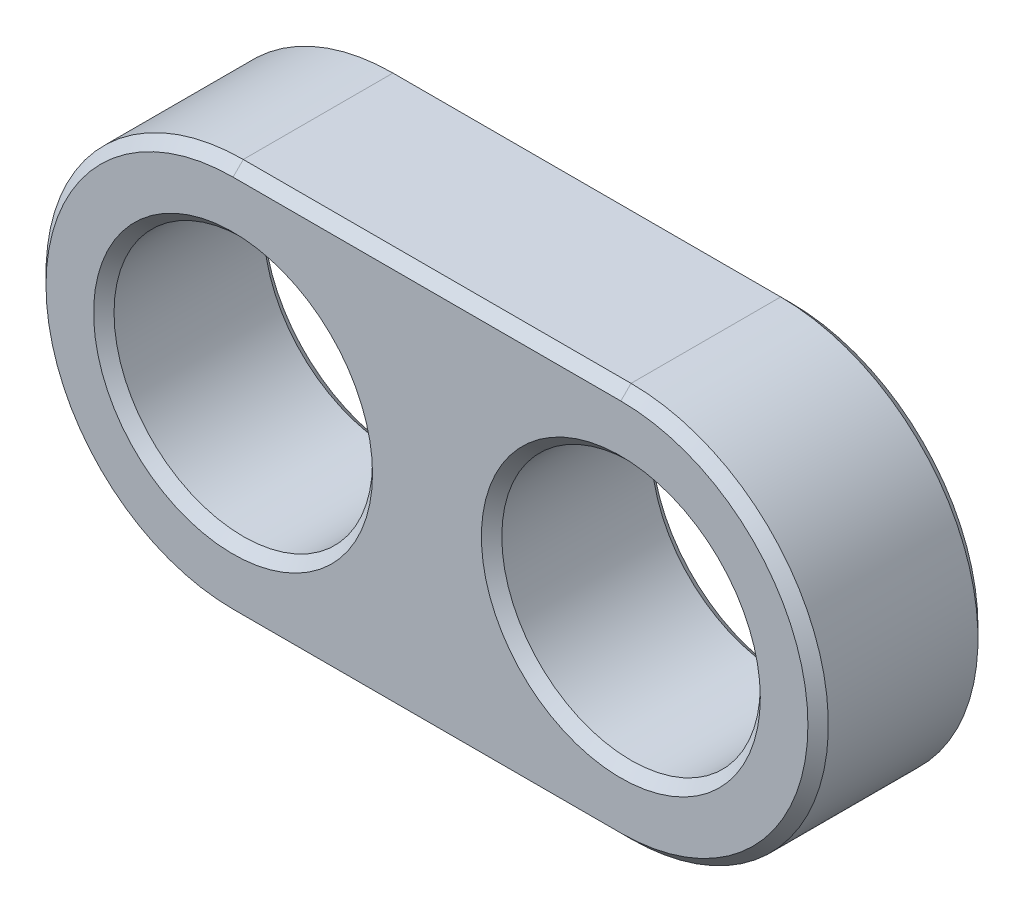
ISO-10303-21;
HEADER;
FILE_DESCRIPTION(('STEP AP214'),'2;1');
FILE_NAME('part.step','',(''),(''),'','','');
FILE_SCHEMA(('AUTOMOTIVE_DESIGN { 1 0 10303 214 1 1 1 1 }'));
ENDSEC;
DATA;
#1=APPLICATION_CONTEXT('core data for automotive mechanical design processes');
#2=APPLICATION_PROTOCOL_DEFINITION('international standard','automotive_design',2000,#1);
#3=PRODUCT_CONTEXT('',#1,'mechanical');
#4=PRODUCT('Part','Part','',(#3));
#5=PRODUCT_RELATED_PRODUCT_CATEGORY('part','',(#4));
#6=PRODUCT_DEFINITION_FORMATION('','',#4);
#7=PRODUCT_DEFINITION_CONTEXT('part definition',#1,'design');
#8=PRODUCT_DEFINITION('design','',#6,#7);
#9=PRODUCT_DEFINITION_SHAPE('','',#8);
#10=(LENGTH_UNIT() NAMED_UNIT(*) SI_UNIT(.MILLI.,.METRE.));
#11=(NAMED_UNIT(*) PLANE_ANGLE_UNIT() SI_UNIT($,.RADIAN.));
#12=(NAMED_UNIT(*) SI_UNIT($,.STERADIAN.) SOLID_ANGLE_UNIT());
#13=UNCERTAINTY_MEASURE_WITH_UNIT(LENGTH_MEASURE(1.E-05),#10,'distance_accuracy_value','');
#14=(GEOMETRIC_REPRESENTATION_CONTEXT(3) GLOBAL_UNCERTAINTY_ASSIGNED_CONTEXT((#13)) GLOBAL_UNIT_ASSIGNED_CONTEXT((#10,
#11,#12)) REPRESENTATION_CONTEXT('',''));
#15=CARTESIAN_POINT('',(0.,0.,0.));
#16=DIRECTION('',(0.,0.,1.));
#17=DIRECTION('',(1.,0.,0.));
#18=AXIS2_PLACEMENT_3D('',#15,#16,#17);
#19=CARTESIAN_POINT('',(0.,0.,12.5));
#20=DIRECTION('',(0.,0.,1.));
#21=DIRECTION('',(1.,0.,0.));
#22=AXIS2_PLACEMENT_3D('',#19,#20,#21);
#23=PLANE('',#22);
#24=DIRECTION('',(1.,0.,0.));
#25=VECTOR('',#24,1.);
#26=CARTESIAN_POINT('',(57.,-27.5,12.5));
#27=LINE('',#26,#25);
#28=CARTESIAN_POINT('',(0.,-27.5,12.5));
#29=VERTEX_POINT('',#28);
#30=CARTESIAN_POINT('',(57.,-27.5,12.5));
#31=VERTEX_POINT('',#30);
#32=EDGE_CURVE('E48',#29,#31,#27,.T.);
#33=ORIENTED_EDGE('',*,*,#32,.T.);
#34=CARTESIAN_POINT('',(57.,0.,12.5));
#35=DIRECTION('',(0.,0.,1.));
#36=DIRECTION('',(1.,0.,0.));
#37=AXIS2_PLACEMENT_3D('',#34,#35,#36);
#38=CIRCLE('',#37,27.5);
#39=CARTESIAN_POINT('',(57.,27.5,12.5));
#40=VERTEX_POINT('',#39);
#41=EDGE_CURVE('E155',#31,#40,#38,.T.);
#42=ORIENTED_EDGE('',*,*,#41,.T.);
#43=DIRECTION('',(-1.,0.,0.));
#44=VECTOR('',#43,1.);
#45=CARTESIAN_POINT('',(0.,27.5,12.5));
#46=LINE('',#45,#44);
#47=CARTESIAN_POINT('',(0.,27.5,12.5));
#48=VERTEX_POINT('',#47);
#49=EDGE_CURVE('E159',#40,#48,#46,.T.);
#50=ORIENTED_EDGE('',*,*,#49,.T.);
#51=CARTESIAN_POINT('',(0.,0.,12.5));
#52=DIRECTION('',(0.,0.,1.));
#53=DIRECTION('',(1.,0.,0.));
#54=AXIS2_PLACEMENT_3D('',#51,#52,#53);
#55=CIRCLE('',#54,27.5);
#56=EDGE_CURVE('E53',#48,#29,#55,.T.);
#57=ORIENTED_EDGE('',*,*,#56,.T.);
#58=EDGE_LOOP('',(#33,#42,#50,#57));
#59=FACE_BOUND('',#58,.T.);
#60=CARTESIAN_POINT('',(57.,0.,12.5));
#61=DIRECTION('',(0.,0.,1.));
#62=DIRECTION('',(1.,0.,0.));
#63=AXIS2_PLACEMENT_3D('',#60,#61,#62);
#64=CIRCLE('',#63,20.5);
#65=CARTESIAN_POINT('',(77.5,0.,12.5));
#66=VERTEX_POINT('',#65);
#67=EDGE_CURVE('E161',#66,#66,#64,.F.);
#68=ORIENTED_EDGE('',*,*,#67,.T.);
#69=EDGE_LOOP('',(#68));
#70=FACE_BOUND('',#69,.T.);
#71=CARTESIAN_POINT('',(0.,0.,12.5));
#72=DIRECTION('',(0.,0.,1.));
#73=DIRECTION('',(1.,0.,0.));
#74=AXIS2_PLACEMENT_3D('',#71,#72,#73);
#75=CIRCLE('',#74,20.5);
#76=CARTESIAN_POINT('',(20.5,0.,12.5));
#77=VERTEX_POINT('',#76);
#78=EDGE_CURVE('E164',#77,#77,#75,.F.);
#79=ORIENTED_EDGE('',*,*,#78,.T.);
#80=EDGE_LOOP('',(#79));
#81=FACE_BOUND('',#80,.T.);
#82=ADVANCED_FACE('F31',(#59,#70,#81),#23,.T.);
#83=CARTESIAN_POINT('',(0.,0.,-12.5));
#84=DIRECTION('',(0.,0.,1.));
#85=DIRECTION('',(1.,0.,0.));
#86=AXIS2_PLACEMENT_3D('',#83,#84,#85);
#87=PLANE('',#86);
#88=DIRECTION('',(-1.,0.,0.));
#89=VECTOR('',#88,1.);
#90=CARTESIAN_POINT('',(0.,-27.5,-12.5));
#91=LINE('',#90,#89);
#92=CARTESIAN_POINT('',(57.,-27.5,-12.5));
#93=VERTEX_POINT('',#92);
#94=CARTESIAN_POINT('',(0.,-27.5,-12.5));
#95=VERTEX_POINT('',#94);
#96=EDGE_CURVE('E178',#93,#95,#91,.T.);
#97=ORIENTED_EDGE('',*,*,#96,.T.);
#98=CARTESIAN_POINT('',(0.,0.,-12.5));
#99=DIRECTION('',(0.,0.,1.));
#100=DIRECTION('',(1.,0.,0.));
#101=AXIS2_PLACEMENT_3D('',#98,#99,#100);
#102=CIRCLE('',#101,27.5);
#103=CARTESIAN_POINT('',(0.,27.5,-12.5));
#104=VERTEX_POINT('',#103);
#105=EDGE_CURVE('E109',#95,#104,#102,.F.);
#106=ORIENTED_EDGE('',*,*,#105,.T.);
#107=DIRECTION('',(1.,0.,0.));
#108=VECTOR('',#107,1.);
#109=CARTESIAN_POINT('',(0.,27.5,-12.5));
#110=LINE('',#109,#108);
#111=CARTESIAN_POINT('',(57.,27.5,-12.5));
#112=VERTEX_POINT('',#111);
#113=EDGE_CURVE('E182',#104,#112,#110,.T.);
#114=ORIENTED_EDGE('',*,*,#113,.T.);
#115=CARTESIAN_POINT('',(57.,0.,-12.5));
#116=DIRECTION('',(0.,0.,1.));
#117=DIRECTION('',(1.,0.,0.));
#118=AXIS2_PLACEMENT_3D('',#115,#116,#117);
#119=CIRCLE('',#118,27.5);
#120=EDGE_CURVE('E180',#112,#93,#119,.F.);
#121=ORIENTED_EDGE('',*,*,#120,.T.);
#122=EDGE_LOOP('',(#97,#106,#114,#121));
#123=FACE_BOUND('',#122,.T.);
#124=CARTESIAN_POINT('',(57.,0.,-12.5));
#125=DIRECTION('',(0.,0.,1.));
#126=DIRECTION('',(1.,0.,0.));
#127=AXIS2_PLACEMENT_3D('',#124,#125,#126);
#128=CIRCLE('',#127,20.5);
#129=CARTESIAN_POINT('',(77.5,0.,-12.5));
#130=VERTEX_POINT('',#129);
#131=EDGE_CURVE('E184',#130,#130,#128,.T.);
#132=ORIENTED_EDGE('',*,*,#131,.T.);
#133=EDGE_LOOP('',(#132));
#134=FACE_BOUND('',#133,.T.);
#135=CARTESIAN_POINT('',(0.,0.,-12.5));
#136=DIRECTION('',(0.,0.,1.));
#137=DIRECTION('',(1.,0.,0.));
#138=AXIS2_PLACEMENT_3D('',#135,#136,#137);
#139=CIRCLE('',#138,20.5);
#140=CARTESIAN_POINT('',(20.5,0.,-12.5));
#141=VERTEX_POINT('',#140);
#142=EDGE_CURVE('E187',#141,#141,#139,.T.);
#143=ORIENTED_EDGE('',*,*,#142,.T.);
#144=EDGE_LOOP('',(#143));
#145=FACE_BOUND('',#144,.T.);
#146=ADVANCED_FACE('F220',(#123,#134,#145),#87,.F.);
#147=CARTESIAN_POINT('',(0.,0.,12.5));
#148=DIRECTION('',(0.,0.,-1.));
#149=DIRECTION('',(-1.,0.,0.));
#150=AXIS2_PLACEMENT_3D('',#147,#148,#149);
#151=CYLINDRICAL_SURFACE('',#150,29.);
#152=DIRECTION('',(0.,0.,-1.));
#153=VECTOR('',#152,1.);
#154=CARTESIAN_POINT('',(0.,29.,12.5));
#155=LINE('',#154,#153);
#156=CARTESIAN_POINT('',(0.,29.,11.));
#157=VERTEX_POINT('',#156);
#158=CARTESIAN_POINT('',(0.,29.,-11.));
#159=VERTEX_POINT('',#158);
#160=EDGE_CURVE('E142',#157,#159,#155,.T.);
#161=ORIENTED_EDGE('',*,*,#160,.T.);
#162=CARTESIAN_POINT('',(0.,0.,-11.));
#163=DIRECTION('',(0.,0.,1.));
#164=DIRECTION('',(1.,0.,0.));
#165=AXIS2_PLACEMENT_3D('',#162,#163,#164);
#166=CIRCLE('',#165,29.);
#167=CARTESIAN_POINT('',(0.,-29.,-11.));
#168=VERTEX_POINT('',#167);
#169=EDGE_CURVE('E119',#159,#168,#166,.T.);
#170=ORIENTED_EDGE('',*,*,#169,.T.);
#171=DIRECTION('',(0.,0.,-1.));
#172=VECTOR('',#171,1.);
#173=CARTESIAN_POINT('',(0.,-29.,12.5));
#174=LINE('',#173,#172);
#175=CARTESIAN_POINT('',(0.,-29.,11.));
#176=VERTEX_POINT('',#175);
#177=EDGE_CURVE('E102',#176,#168,#174,.T.);
#178=ORIENTED_EDGE('',*,*,#177,.F.);
#179=CARTESIAN_POINT('',(0.,0.,11.));
#180=DIRECTION('',(0.,0.,1.));
#181=DIRECTION('',(1.,0.,0.));
#182=AXIS2_PLACEMENT_3D('',#179,#180,#181);
#183=CIRCLE('',#182,29.);
#184=EDGE_CURVE('E116',#176,#157,#183,.F.);
#185=ORIENTED_EDGE('',*,*,#184,.T.);
#186=EDGE_LOOP('',(#161,#170,#178,#185));
#187=FACE_BOUND('',#186,.T.);
#188=ADVANCED_FACE('F115',(#187),#151,.T.);
#189=CARTESIAN_POINT('',(57.,-29.,12.5));
#190=DIRECTION('',(0.,1.,0.));
#191=DIRECTION('',(0.,0.,1.));
#192=AXIS2_PLACEMENT_3D('',#189,#190,#191);
#193=PLANE('',#192);
#194=ORIENTED_EDGE('',*,*,#177,.T.);
#195=DIRECTION('',(1.,0.,0.));
#196=VECTOR('',#195,1.);
#197=CARTESIAN_POINT('',(57.,-29.,-11.));
#198=LINE('',#197,#196);
#199=CARTESIAN_POINT('',(57.,-29.,-11.));
#200=VERTEX_POINT('',#199);
#201=EDGE_CURVE('E108',#168,#200,#198,.T.);
#202=ORIENTED_EDGE('',*,*,#201,.T.);
#203=DIRECTION('',(0.,0.,-1.));
#204=VECTOR('',#203,1.);
#205=CARTESIAN_POINT('',(57.,-29.,12.5));
#206=LINE('',#205,#204);
#207=CARTESIAN_POINT('',(57.,-29.,11.));
#208=VERTEX_POINT('',#207);
#209=EDGE_CURVE('E104',#208,#200,#206,.T.);
#210=ORIENTED_EDGE('',*,*,#209,.F.);
#211=DIRECTION('',(-1.,0.,0.));
#212=VECTOR('',#211,1.);
#213=CARTESIAN_POINT('',(0.,-29.,11.));
#214=LINE('',#213,#212);
#215=EDGE_CURVE('E99',#208,#176,#214,.T.);
#216=ORIENTED_EDGE('',*,*,#215,.T.);
#217=EDGE_LOOP('',(#194,#202,#210,#216));
#218=FACE_BOUND('',#217,.T.);
#219=ADVANCED_FACE('F101',(#218),#193,.F.);
#220=CARTESIAN_POINT('',(57.,0.,12.5));
#221=DIRECTION('',(0.,0.,-1.));
#222=DIRECTION('',(-1.,0.,0.));
#223=AXIS2_PLACEMENT_3D('',#220,#221,#222);
#224=CYLINDRICAL_SURFACE('',#223,29.);
#225=ORIENTED_EDGE('',*,*,#209,.T.);
#226=CARTESIAN_POINT('',(57.,0.,-11.));
#227=DIRECTION('',(0.,0.,1.));
#228=DIRECTION('',(1.,0.,0.));
#229=AXIS2_PLACEMENT_3D('',#226,#227,#228);
#230=CIRCLE('',#229,29.);
#231=CARTESIAN_POINT('',(57.,29.,-11.));
#232=VERTEX_POINT('',#231);
#233=EDGE_CURVE('E171',#200,#232,#230,.T.);
#234=ORIENTED_EDGE('',*,*,#233,.T.);
#235=DIRECTION('',(0.,0.,-1.));
#236=VECTOR('',#235,1.);
#237=CARTESIAN_POINT('',(57.,29.,12.5));
#238=LINE('',#237,#236);
#239=CARTESIAN_POINT('',(57.,29.,11.));
#240=VERTEX_POINT('',#239);
#241=EDGE_CURVE('E192',#240,#232,#238,.T.);
#242=ORIENTED_EDGE('',*,*,#241,.F.);
#243=CARTESIAN_POINT('',(57.,0.,11.));
#244=DIRECTION('',(0.,0.,1.));
#245=DIRECTION('',(1.,0.,0.));
#246=AXIS2_PLACEMENT_3D('',#243,#244,#245);
#247=CIRCLE('',#246,29.);
#248=EDGE_CURVE('E173',#240,#208,#247,.F.);
#249=ORIENTED_EDGE('',*,*,#248,.T.);
#250=EDGE_LOOP('',(#225,#234,#242,#249));
#251=FACE_BOUND('',#250,.T.);
#252=ADVANCED_FACE('F212',(#251),#224,.T.);
#253=CARTESIAN_POINT('',(0.,29.,12.5));
#254=DIRECTION('',(0.,-1.,0.));
#255=DIRECTION('',(0.,0.,-1.));
#256=AXIS2_PLACEMENT_3D('',#253,#254,#255);
#257=PLANE('',#256);
#258=ORIENTED_EDGE('',*,*,#241,.T.);
#259=DIRECTION('',(-1.,0.,0.));
#260=VECTOR('',#259,1.);
#261=CARTESIAN_POINT('',(0.,29.,-11.));
#262=LINE('',#261,#260);
#263=EDGE_CURVE('E167',#232,#159,#262,.T.);
#264=ORIENTED_EDGE('',*,*,#263,.T.);
#265=ORIENTED_EDGE('',*,*,#160,.F.);
#266=DIRECTION('',(1.,0.,0.));
#267=VECTOR('',#266,1.);
#268=CARTESIAN_POINT('',(57.,29.,11.));
#269=LINE('',#268,#267);
#270=EDGE_CURVE('E169',#157,#240,#269,.T.);
#271=ORIENTED_EDGE('',*,*,#270,.T.);
#272=EDGE_LOOP('',(#258,#264,#265,#271));
#273=FACE_BOUND('',#272,.T.);
#274=ADVANCED_FACE('F252',(#273),#257,.F.);
#275=CARTESIAN_POINT('',(0.,0.,12.5));
#276=DIRECTION('',(0.,0.,-1.));
#277=DIRECTION('',(-1.,0.,0.));
#278=AXIS2_PLACEMENT_3D('',#275,#276,#277);
#279=CYLINDRICAL_SURFACE('',#278,19.);
#280=CARTESIAN_POINT('',(0.,0.,-11.));
#281=DIRECTION('',(0.,0.,1.));
#282=DIRECTION('',(1.,0.,0.));
#283=AXIS2_PLACEMENT_3D('',#280,#281,#282);
#284=CIRCLE('',#283,19.);
#285=CARTESIAN_POINT('',(19.,0.,-11.));
#286=VERTEX_POINT('',#285);
#287=EDGE_CURVE('E11',#286,#286,#284,.F.);
#288=ORIENTED_EDGE('',*,*,#287,.T.);
#289=EDGE_LOOP('',(#288));
#290=FACE_BOUND('',#289,.T.);
#291=CARTESIAN_POINT('',(0.,0.,11.));
#292=DIRECTION('',(0.,0.,1.));
#293=DIRECTION('',(1.,0.,0.));
#294=AXIS2_PLACEMENT_3D('',#291,#292,#293);
#295=CIRCLE('',#294,19.);
#296=CARTESIAN_POINT('',(19.,0.,11.));
#297=VERTEX_POINT('',#296);
#298=EDGE_CURVE('E40',#297,#297,#295,.T.);
#299=ORIENTED_EDGE('',*,*,#298,.T.);
#300=EDGE_LOOP('',(#299));
#301=FACE_BOUND('',#300,.T.);
#302=ADVANCED_FACE('F249',(#290,#301),#279,.F.);
#303=CARTESIAN_POINT('',(57.,0.,12.5));
#304=DIRECTION('',(0.,0.,-1.));
#305=DIRECTION('',(-1.,0.,0.));
#306=AXIS2_PLACEMENT_3D('',#303,#304,#305);
#307=CYLINDRICAL_SURFACE('',#306,19.);
#308=CARTESIAN_POINT('',(57.,0.,-11.));
#309=DIRECTION('',(0.,0.,1.));
#310=DIRECTION('',(1.,0.,0.));
#311=AXIS2_PLACEMENT_3D('',#308,#309,#310);
#312=CIRCLE('',#311,19.);
#313=CARTESIAN_POINT('',(76.,0.,-11.));
#314=VERTEX_POINT('',#313);
#315=EDGE_CURVE('E149',#314,#314,#312,.F.);
#316=ORIENTED_EDGE('',*,*,#315,.T.);
#317=EDGE_LOOP('',(#316));
#318=FACE_BOUND('',#317,.T.);
#319=CARTESIAN_POINT('',(57.,0.,11.));
#320=DIRECTION('',(0.,0.,1.));
#321=DIRECTION('',(1.,0.,0.));
#322=AXIS2_PLACEMENT_3D('',#319,#320,#321);
#323=CIRCLE('',#322,19.);
#324=CARTESIAN_POINT('',(76.,0.,11.));
#325=VERTEX_POINT('',#324);
#326=EDGE_CURVE('E152',#325,#325,#323,.T.);
#327=ORIENTED_EDGE('',*,*,#326,.T.);
#328=EDGE_LOOP('',(#327));
#329=FACE_BOUND('',#328,.T.);
#330=ADVANCED_FACE('F269',(#318,#329),#307,.F.);
#331=CARTESIAN_POINT('',(57.,0.,-11.));
#332=DIRECTION('',(0.,0.,1.));
#333=DIRECTION('',(1.,0.,0.));
#334=AXIS2_PLACEMENT_3D('',#331,#332,#333);
#335=CONICAL_SURFACE('',#334,29.,0.785398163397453);
#336=DIRECTION('',(0.,-0.707106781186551,0.707106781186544));
#337=VECTOR('',#336,1.);
#338=CARTESIAN_POINT('',(57.,-27.5,-12.5));
#339=LINE('',#338,#337);
#340=EDGE_CURVE('E143',#93,#200,#339,.T.);
#341=ORIENTED_EDGE('',*,*,#340,.F.);
#342=ORIENTED_EDGE('',*,*,#120,.F.);
#343=DIRECTION('',(0.,-0.707106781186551,-0.707106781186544));
#344=VECTOR('',#343,1.);
#345=CARTESIAN_POINT('',(57.,29.,-11.));
#346=LINE('',#345,#344);
#347=EDGE_CURVE('E139',#232,#112,#346,.T.);
#348=ORIENTED_EDGE('',*,*,#347,.F.);
#349=ORIENTED_EDGE('',*,*,#233,.F.);
#350=EDGE_LOOP('',(#341,#342,#348,#349));
#351=FACE_BOUND('',#350,.T.);
#352=ADVANCED_FACE('F217',(#351),#335,.T.);
#353=CARTESIAN_POINT('',(0.,29.,-11.));
#354=DIRECTION('',(0.,-0.707106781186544,0.707106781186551));
#355=DIRECTION('',(0.,-0.707106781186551,-0.707106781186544));
#356=AXIS2_PLACEMENT_3D('',#353,#354,#355);
#357=PLANE('',#356);
#358=ORIENTED_EDGE('',*,*,#347,.T.);
#359=ORIENTED_EDGE('',*,*,#113,.F.);
#360=DIRECTION('',(0.,-0.707106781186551,-0.707106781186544));
#361=VECTOR('',#360,1.);
#362=CARTESIAN_POINT('',(0.,29.,-11.));
#363=LINE('',#362,#361);
#364=EDGE_CURVE('E130',#159,#104,#363,.T.);
#365=ORIENTED_EDGE('',*,*,#364,.F.);
#366=ORIENTED_EDGE('',*,*,#263,.F.);
#367=EDGE_LOOP('',(#358,#359,#365,#366));
#368=FACE_BOUND('',#367,.T.);
#369=ADVANCED_FACE('F200',(#368),#357,.F.);
#370=CARTESIAN_POINT('',(57.,-29.,-11.));
#371=DIRECTION('',(0.,0.707106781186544,0.707106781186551));
#372=DIRECTION('',(0.,-0.707106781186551,0.707106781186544));
#373=AXIS2_PLACEMENT_3D('',#370,#371,#372);
#374=PLANE('',#373);
#375=ORIENTED_EDGE('',*,*,#340,.T.);
#376=ORIENTED_EDGE('',*,*,#201,.F.);
#377=DIRECTION('',(0.,-0.707106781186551,0.707106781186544));
#378=VECTOR('',#377,1.);
#379=CARTESIAN_POINT('',(0.,-27.5,-12.5));
#380=LINE('',#379,#378);
#381=EDGE_CURVE('E129',#95,#168,#380,.T.);
#382=ORIENTED_EDGE('',*,*,#381,.F.);
#383=ORIENTED_EDGE('',*,*,#96,.F.);
#384=EDGE_LOOP('',(#375,#376,#382,#383));
#385=FACE_BOUND('',#384,.T.);
#386=ADVANCED_FACE('F208',(#385),#374,.F.);
#387=CARTESIAN_POINT('',(0.,0.,-11.));
#388=DIRECTION('',(0.,0.,1.));
#389=DIRECTION('',(1.,0.,0.));
#390=AXIS2_PLACEMENT_3D('',#387,#388,#389);
#391=CONICAL_SURFACE('',#390,29.,0.785398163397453);
#392=ORIENTED_EDGE('',*,*,#364,.T.);
#393=ORIENTED_EDGE('',*,*,#105,.F.);
#394=ORIENTED_EDGE('',*,*,#381,.T.);
#395=ORIENTED_EDGE('',*,*,#169,.F.);
#396=EDGE_LOOP('',(#392,#393,#394,#395));
#397=FACE_BOUND('',#396,.T.);
#398=ADVANCED_FACE('F203',(#397),#391,.T.);
#399=CARTESIAN_POINT('',(0.,0.,12.5));
#400=DIRECTION('',(0.,0.,-1.));
#401=DIRECTION('',(-1.,0.,0.));
#402=AXIS2_PLACEMENT_3D('',#399,#400,#401);
#403=CONICAL_SURFACE('',#402,27.5,0.785398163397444);
#404=DIRECTION('',(0.,-0.707106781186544,0.707106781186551));
#405=VECTOR('',#404,1.);
#406=CARTESIAN_POINT('',(0.,29.,11.));
#407=LINE('',#406,#405);
#408=EDGE_CURVE('E125',#157,#48,#407,.T.);
#409=ORIENTED_EDGE('',*,*,#408,.F.);
#410=ORIENTED_EDGE('',*,*,#184,.F.);
#411=DIRECTION('',(0.,-0.707106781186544,-0.707106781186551));
#412=VECTOR('',#411,1.);
#413=CARTESIAN_POINT('',(0.,-27.5,12.5));
#414=LINE('',#413,#412);
#415=EDGE_CURVE('E35',#29,#176,#414,.T.);
#416=ORIENTED_EDGE('',*,*,#415,.F.);
#417=ORIENTED_EDGE('',*,*,#56,.F.);
#418=EDGE_LOOP('',(#409,#410,#416,#417));
#419=FACE_BOUND('',#418,.T.);
#420=ADVANCED_FACE('F123',(#419),#403,.T.);
#421=CARTESIAN_POINT('',(0.,-27.5,12.5));
#422=DIRECTION('',(0.,-0.707106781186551,0.707106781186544));
#423=DIRECTION('',(0.,-0.707106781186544,-0.707106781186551));
#424=AXIS2_PLACEMENT_3D('',#421,#422,#423);
#425=PLANE('',#424);
#426=ORIENTED_EDGE('',*,*,#415,.T.);
#427=ORIENTED_EDGE('',*,*,#215,.F.);
#428=DIRECTION('',(0.,-0.707106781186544,-0.707106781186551));
#429=VECTOR('',#428,1.);
#430=CARTESIAN_POINT('',(57.,-27.5,12.5));
#431=LINE('',#430,#429);
#432=EDGE_CURVE('E132',#31,#208,#431,.T.);
#433=ORIENTED_EDGE('',*,*,#432,.F.);
#434=ORIENTED_EDGE('',*,*,#32,.F.);
#435=EDGE_LOOP('',(#426,#427,#433,#434));
#436=FACE_BOUND('',#435,.T.);
#437=ADVANCED_FACE('F128',(#436),#425,.T.);
#438=CARTESIAN_POINT('',(0.,27.5,12.5));
#439=DIRECTION('',(0.,0.707106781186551,0.707106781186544));
#440=DIRECTION('',(0.,-0.707106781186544,0.707106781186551));
#441=AXIS2_PLACEMENT_3D('',#438,#439,#440);
#442=PLANE('',#441);
#443=ORIENTED_EDGE('',*,*,#408,.T.);
#444=ORIENTED_EDGE('',*,*,#49,.F.);
#445=DIRECTION('',(0.,-0.707106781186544,0.707106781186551));
#446=VECTOR('',#445,1.);
#447=CARTESIAN_POINT('',(57.,29.,11.));
#448=LINE('',#447,#446);
#449=EDGE_CURVE('E135',#240,#40,#448,.T.);
#450=ORIENTED_EDGE('',*,*,#449,.F.);
#451=ORIENTED_EDGE('',*,*,#270,.F.);
#452=EDGE_LOOP('',(#443,#444,#450,#451));
#453=FACE_BOUND('',#452,.T.);
#454=ADVANCED_FACE('F272',(#453),#442,.T.);
#455=CARTESIAN_POINT('',(57.,0.,12.5));
#456=DIRECTION('',(0.,0.,-1.));
#457=DIRECTION('',(-1.,0.,0.));
#458=AXIS2_PLACEMENT_3D('',#455,#456,#457);
#459=CONICAL_SURFACE('',#458,27.5,0.785398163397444);
#460=ORIENTED_EDGE('',*,*,#432,.T.);
#461=ORIENTED_EDGE('',*,*,#248,.F.);
#462=ORIENTED_EDGE('',*,*,#449,.T.);
#463=ORIENTED_EDGE('',*,*,#41,.F.);
#464=EDGE_LOOP('',(#460,#461,#462,#463));
#465=FACE_BOUND('',#464,.T.);
#466=ADVANCED_FACE('F239',(#465),#459,.T.);
#467=CARTESIAN_POINT('',(57.,0.,-12.5));
#468=DIRECTION('',(0.,0.,-1.));
#469=DIRECTION('',(-1.,0.,0.));
#470=AXIS2_PLACEMENT_3D('',#467,#468,#469);
#471=CONICAL_SURFACE('',#470,20.5,0.785398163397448);
#472=ORIENTED_EDGE('',*,*,#315,.F.);
#473=EDGE_LOOP('',(#472));
#474=FACE_BOUND('',#473,.T.);
#475=ORIENTED_EDGE('',*,*,#131,.F.);
#476=EDGE_LOOP('',(#475));
#477=FACE_BOUND('',#476,.T.);
#478=ADVANCED_FACE('F231',(#474,#477),#471,.F.);
#479=CARTESIAN_POINT('',(0.,0.,-12.5));
#480=DIRECTION('',(0.,0.,-1.));
#481=DIRECTION('',(-1.,0.,0.));
#482=AXIS2_PLACEMENT_3D('',#479,#480,#481);
#483=CONICAL_SURFACE('',#482,20.5,0.785398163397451);
#484=ORIENTED_EDGE('',*,*,#287,.F.);
#485=EDGE_LOOP('',(#484));
#486=FACE_BOUND('',#485,.T.);
#487=ORIENTED_EDGE('',*,*,#142,.F.);
#488=EDGE_LOOP('',(#487));
#489=FACE_BOUND('',#488,.T.);
#490=ADVANCED_FACE('F228',(#486,#489),#483,.F.);
#491=CARTESIAN_POINT('',(57.,0.,11.));
#492=DIRECTION('',(0.,0.,1.));
#493=DIRECTION('',(1.,0.,0.));
#494=AXIS2_PLACEMENT_3D('',#491,#492,#493);
#495=CONICAL_SURFACE('',#494,19.,0.785398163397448);
#496=ORIENTED_EDGE('',*,*,#67,.F.);
#497=EDGE_LOOP('',(#496));
#498=FACE_BOUND('',#497,.T.);
#499=ORIENTED_EDGE('',*,*,#326,.F.);
#500=EDGE_LOOP('',(#499));
#501=FACE_BOUND('',#500,.T.);
#502=ADVANCED_FACE('F230',(#498,#501),#495,.F.);
#503=CARTESIAN_POINT('',(0.,0.,11.));
#504=DIRECTION('',(0.,0.,1.));
#505=DIRECTION('',(1.,0.,0.));
#506=AXIS2_PLACEMENT_3D('',#503,#504,#505);
#507=CONICAL_SURFACE('',#506,19.,0.785398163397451);
#508=ORIENTED_EDGE('',*,*,#78,.F.);
#509=EDGE_LOOP('',(#508));
#510=FACE_BOUND('',#509,.T.);
#511=ORIENTED_EDGE('',*,*,#298,.F.);
#512=EDGE_LOOP('',(#511));
#513=FACE_BOUND('',#512,.T.);
#514=ADVANCED_FACE('F33',(#510,#513),#507,.F.);
#515=CLOSED_SHELL('',(#82,#146,#188,#219,#252,#274,#302,#330,#352,#369,#386,#398,#420,#437,#454,
#466,#478,#490,#502,#514));
#516=MANIFOLD_SOLID_BREP('B2',#515);
#517=ADVANCED_BREP_SHAPE_REPRESENTATION('',(#18,#516),#14);
#518=SHAPE_DEFINITION_REPRESENTATION(#9,#517);
ENDSEC;
END-ISO-10303-21;
